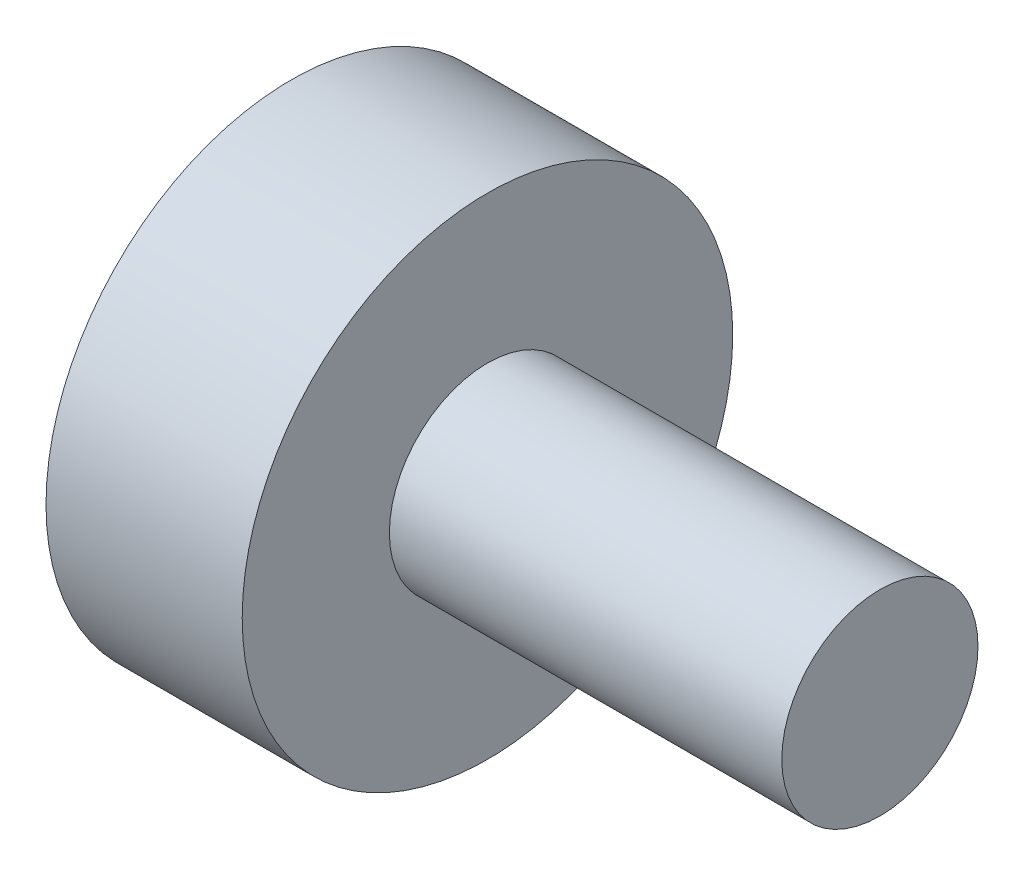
ISO-10303-21;
HEADER;
FILE_DESCRIPTION(('STEP AP214'),'2;1');
FILE_NAME('part.step','',(''),(''),'','','');
FILE_SCHEMA(('AUTOMOTIVE_DESIGN { 1 0 10303 214 1 1 1 1 }'));
ENDSEC;
DATA;
#1=APPLICATION_CONTEXT('core data for automotive mechanical design processes');
#2=APPLICATION_PROTOCOL_DEFINITION('international standard','automotive_design',2000,#1);
#3=PRODUCT_CONTEXT('',#1,'mechanical');
#4=PRODUCT('Part','Part','',(#3));
#5=PRODUCT_RELATED_PRODUCT_CATEGORY('part','',(#4));
#6=PRODUCT_DEFINITION_FORMATION('','',#4);
#7=PRODUCT_DEFINITION_CONTEXT('part definition',#1,'design');
#8=PRODUCT_DEFINITION('design','',#6,#7);
#9=PRODUCT_DEFINITION_SHAPE('','',#8);
#10=(LENGTH_UNIT() NAMED_UNIT(*) SI_UNIT(.MILLI.,.METRE.));
#11=(NAMED_UNIT(*) PLANE_ANGLE_UNIT() SI_UNIT($,.RADIAN.));
#12=(NAMED_UNIT(*) SI_UNIT($,.STERADIAN.) SOLID_ANGLE_UNIT());
#13=UNCERTAINTY_MEASURE_WITH_UNIT(LENGTH_MEASURE(1.E-05),#10,'distance_accuracy_value','');
#14=(GEOMETRIC_REPRESENTATION_CONTEXT(3) GLOBAL_UNCERTAINTY_ASSIGNED_CONTEXT((#13)) GLOBAL_UNIT_ASSIGNED_CONTEXT((#10,
#11,#12)) REPRESENTATION_CONTEXT('',''));
#15=CARTESIAN_POINT('',(0.,0.,0.));
#16=DIRECTION('',(0.,0.,1.));
#17=DIRECTION('',(1.,0.,0.));
#18=AXIS2_PLACEMENT_3D('',#15,#16,#17);
#19=CARTESIAN_POINT('',(0.,0.,0.));
#20=DIRECTION('',(1.,0.,0.));
#21=DIRECTION('',(0.,0.,-1.));
#22=AXIS2_PLACEMENT_3D('',#19,#20,#21);
#23=PLANE('',#22);
#24=CARTESIAN_POINT('',(0.,0.,0.));
#25=DIRECTION('',(-1.,0.,0.));
#26=DIRECTION('',(0.,0.,1.));
#27=AXIS2_PLACEMENT_3D('',#24,#25,#26);
#28=CIRCLE('',#27,25.);
#29=CARTESIAN_POINT('',(0.,0.,25.));
#30=VERTEX_POINT('',#29);
#31=EDGE_CURVE('E10',#30,#30,#28,.T.);
#32=ORIENTED_EDGE('',*,*,#31,.T.);
#33=EDGE_LOOP('',(#32));
#34=FACE_BOUND('',#33,.T.);
#35=ADVANCED_FACE('F29',(#34),#23,.F.);
#36=CARTESIAN_POINT('',(-9.42873141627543,0.,0.));
#37=DIRECTION('',(-1.,0.,0.));
#38=DIRECTION('',(0.,0.,1.));
#39=AXIS2_PLACEMENT_3D('',#36,#37,#38);
#40=CYLINDRICAL_SURFACE('',#39,25.);
#41=ORIENTED_EDGE('',*,*,#31,.F.);
#42=EDGE_LOOP('',(#41));
#43=FACE_BOUND('',#42,.T.);
#44=CARTESIAN_POINT('',(20.,0.,0.));
#45=DIRECTION('',(-1.,0.,0.));
#46=DIRECTION('',(0.,0.,1.));
#47=AXIS2_PLACEMENT_3D('',#44,#45,#46);
#48=CIRCLE('',#47,25.);
#49=CARTESIAN_POINT('',(20.,0.,25.));
#50=VERTEX_POINT('',#49);
#51=EDGE_CURVE('E35',#50,#50,#48,.T.);
#52=ORIENTED_EDGE('',*,*,#51,.T.);
#53=EDGE_LOOP('',(#52));
#54=FACE_BOUND('',#53,.T.);
#55=ADVANCED_FACE('F61',(#43,#54),#40,.T.);
#56=CARTESIAN_POINT('',(20.,25.,0.));
#57=DIRECTION('',(-1.,0.,0.));
#58=DIRECTION('',(0.,0.,1.));
#59=AXIS2_PLACEMENT_3D('',#56,#57,#58);
#60=PLANE('',#59);
#61=ORIENTED_EDGE('',*,*,#51,.F.);
#62=EDGE_LOOP('',(#61));
#63=FACE_BOUND('',#62,.T.);
#64=CARTESIAN_POINT('',(20.,0.,0.));
#65=DIRECTION('',(-1.,0.,0.));
#66=DIRECTION('',(0.,0.,1.));
#67=AXIS2_PLACEMENT_3D('',#64,#65,#66);
#68=CIRCLE('',#67,10.);
#69=CARTESIAN_POINT('',(20.,0.,10.));
#70=VERTEX_POINT('',#69);
#71=EDGE_CURVE('E39',#70,#70,#68,.T.);
#72=ORIENTED_EDGE('',*,*,#71,.T.);
#73=EDGE_LOOP('',(#72));
#74=FACE_BOUND('',#73,.T.);
#75=ADVANCED_FACE('F57',(#63,#74),#60,.F.);
#76=CARTESIAN_POINT('',(-9.42873141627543,0.,0.));
#77=DIRECTION('',(-1.,0.,0.));
#78=DIRECTION('',(0.,0.,1.));
#79=AXIS2_PLACEMENT_3D('',#76,#77,#78);
#80=CYLINDRICAL_SURFACE('',#79,10.);
#81=ORIENTED_EDGE('',*,*,#71,.F.);
#82=EDGE_LOOP('',(#81));
#83=FACE_BOUND('',#82,.T.);
#84=CARTESIAN_POINT('',(60.,0.,0.));
#85=DIRECTION('',(-1.,0.,0.));
#86=DIRECTION('',(0.,0.,1.));
#87=AXIS2_PLACEMENT_3D('',#84,#85,#86);
#88=CIRCLE('',#87,10.);
#89=CARTESIAN_POINT('',(60.,0.,10.));
#90=VERTEX_POINT('',#89);
#91=EDGE_CURVE('E43',#90,#90,#88,.T.);
#92=ORIENTED_EDGE('',*,*,#91,.T.);
#93=EDGE_LOOP('',(#92));
#94=FACE_BOUND('',#93,.T.);
#95=ADVANCED_FACE('F49',(#83,#94),#80,.T.);
#96=CARTESIAN_POINT('',(60.,10.,0.));
#97=DIRECTION('',(-1.,0.,0.));
#98=DIRECTION('',(0.,0.,1.));
#99=AXIS2_PLACEMENT_3D('',#96,#97,#98);
#100=PLANE('',#99);
#101=ORIENTED_EDGE('',*,*,#91,.F.);
#102=EDGE_LOOP('',(#101));
#103=FACE_BOUND('',#102,.T.);
#104=ADVANCED_FACE('F51',(#103),#100,.F.);
#105=CLOSED_SHELL('',(#35,#55,#75,#95,#104));
#106=MANIFOLD_SOLID_BREP('B2',#105);
#107=ADVANCED_BREP_SHAPE_REPRESENTATION('',(#18,#106),#14);
#108=SHAPE_DEFINITION_REPRESENTATION(#9,#107);
ENDSEC;
END-ISO-10303-21;
